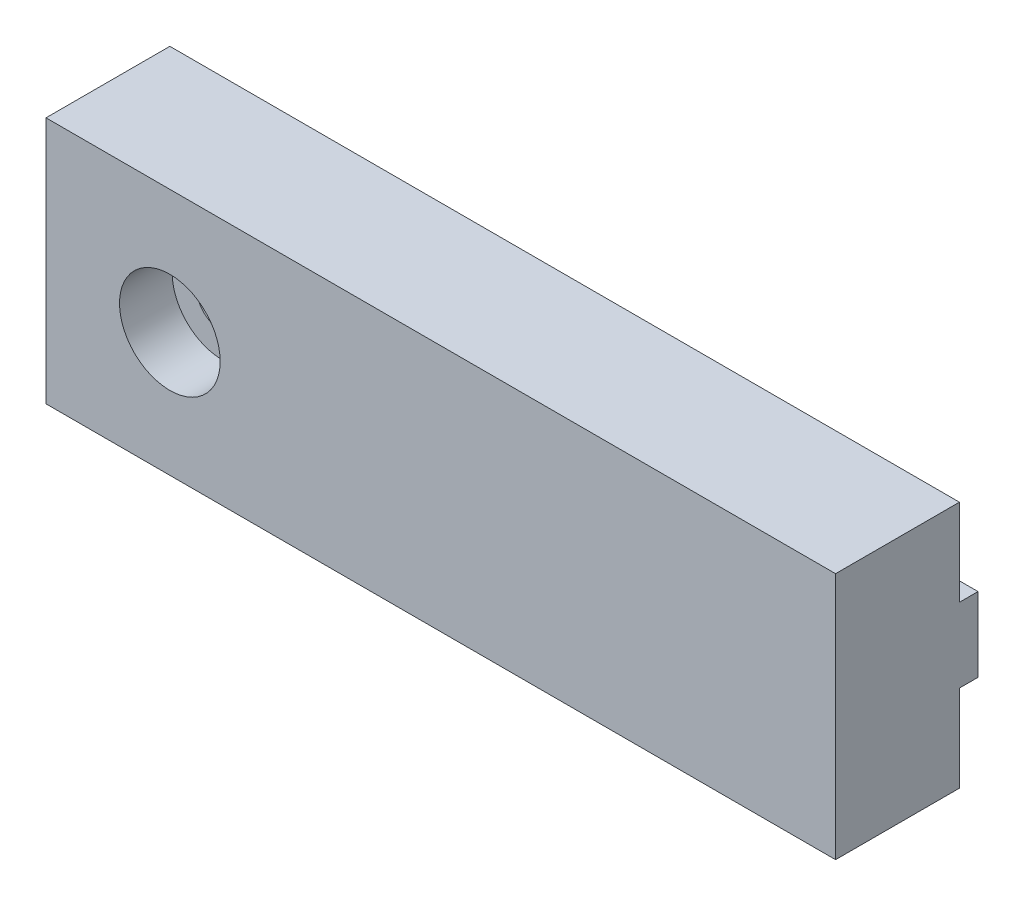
ISO-10303-21;
HEADER;
FILE_DESCRIPTION(('STEP AP214'),'2;1');
FILE_NAME('part.step','',(''),(''),'','','');
FILE_SCHEMA(('AUTOMOTIVE_DESIGN { 1 0 10303 214 1 1 1 1 }'));
ENDSEC;
DATA;
#1=APPLICATION_CONTEXT('core data for automotive mechanical design processes');
#2=APPLICATION_PROTOCOL_DEFINITION('international standard','automotive_design',2000,#1);
#3=PRODUCT_CONTEXT('',#1,'mechanical');
#4=PRODUCT('Part','Part','',(#3));
#5=PRODUCT_RELATED_PRODUCT_CATEGORY('part','',(#4));
#6=PRODUCT_DEFINITION_FORMATION('','',#4);
#7=PRODUCT_DEFINITION_CONTEXT('part definition',#1,'design');
#8=PRODUCT_DEFINITION('design','',#6,#7);
#9=PRODUCT_DEFINITION_SHAPE('','',#8);
#10=(LENGTH_UNIT() NAMED_UNIT(*) SI_UNIT(.MILLI.,.METRE.));
#11=(NAMED_UNIT(*) PLANE_ANGLE_UNIT() SI_UNIT($,.RADIAN.));
#12=(NAMED_UNIT(*) SI_UNIT($,.STERADIAN.) SOLID_ANGLE_UNIT());
#13=UNCERTAINTY_MEASURE_WITH_UNIT(LENGTH_MEASURE(1.E-05),#10,'distance_accuracy_value','');
#14=(GEOMETRIC_REPRESENTATION_CONTEXT(3) GLOBAL_UNCERTAINTY_ASSIGNED_CONTEXT((#13)) GLOBAL_UNIT_ASSIGNED_CONTEXT((#10,
#11,#12)) REPRESENTATION_CONTEXT('',''));
#15=CARTESIAN_POINT('',(0.,0.,0.));
#16=DIRECTION('',(0.,0.,1.));
#17=DIRECTION('',(1.,0.,0.));
#18=AXIS2_PLACEMENT_3D('',#15,#16,#17);
#19=CARTESIAN_POINT('',(0.,0.,0.));
#20=DIRECTION('',(0.,0.,-1.));
#21=DIRECTION('',(-1.,0.,0.));
#22=AXIS2_PLACEMENT_3D('',#19,#20,#21);
#23=PLANE('',#22);
#24=DIRECTION('',(1.,0.,0.));
#25=VECTOR('',#24,1.);
#26=CARTESIAN_POINT('',(25.5,2.4,0.));
#27=LINE('',#26,#25);
#28=CARTESIAN_POINT('',(-25.5,2.4,0.));
#29=VERTEX_POINT('',#28);
#30=CARTESIAN_POINT('',(25.5,2.4,0.));
#31=VERTEX_POINT('',#30);
#32=EDGE_CURVE('E50',#29,#31,#27,.T.);
#33=ORIENTED_EDGE('',*,*,#32,.F.);
#34=DIRECTION('',(0.,-1.,0.));
#35=VECTOR('',#34,1.);
#36=CARTESIAN_POINT('',(-25.5,-8.,0.));
#37=LINE('',#36,#35);
#38=CARTESIAN_POINT('',(-25.5,8.,0.));
#39=VERTEX_POINT('',#38);
#40=EDGE_CURVE('E144',#39,#29,#37,.T.);
#41=ORIENTED_EDGE('',*,*,#40,.F.);
#42=DIRECTION('',(-1.,0.,0.));
#43=VECTOR('',#42,1.);
#44=CARTESIAN_POINT('',(-25.5,8.,0.));
#45=LINE('',#44,#43);
#46=CARTESIAN_POINT('',(25.5,8.,0.));
#47=VERTEX_POINT('',#46);
#48=EDGE_CURVE('E141',#47,#39,#45,.T.);
#49=ORIENTED_EDGE('',*,*,#48,.F.);
#50=DIRECTION('',(0.,1.,0.));
#51=VECTOR('',#50,1.);
#52=CARTESIAN_POINT('',(25.5,-8.,0.));
#53=LINE('',#52,#51);
#54=EDGE_CURVE('E55',#31,#47,#53,.T.);
#55=ORIENTED_EDGE('',*,*,#54,.F.);
#56=EDGE_LOOP('',(#33,#41,#49,#55));
#57=FACE_BOUND('',#56,.T.);
#58=ADVANCED_FACE('F35',(#57),#23,.T.);
#59=CARTESIAN_POINT('',(25.5,-8.,8.));
#60=DIRECTION('',(-1.,0.,0.));
#61=DIRECTION('',(0.,0.,1.));
#62=AXIS2_PLACEMENT_3D('',#59,#60,#61);
#63=PLANE('',#62);
#64=CARTESIAN_POINT('',(25.5,-8.,0.));
#65=VERTEX_POINT('',#64);
#66=CARTESIAN_POINT('',(25.5,-2.4,0.));
#67=VERTEX_POINT('',#66);
#68=EDGE_CURVE('E123',#65,#67,#53,.T.);
#69=ORIENTED_EDGE('',*,*,#68,.T.);
#70=DIRECTION('',(0.,0.,1.));
#71=VECTOR('',#70,1.);
#72=CARTESIAN_POINT('',(25.5,-2.4,-1.2));
#73=LINE('',#72,#71);
#74=CARTESIAN_POINT('',(25.5,-2.4,-1.2));
#75=VERTEX_POINT('',#74);
#76=EDGE_CURVE('E104',#75,#67,#73,.T.);
#77=ORIENTED_EDGE('',*,*,#76,.F.);
#78=DIRECTION('',(0.,-1.,0.));
#79=VECTOR('',#78,1.);
#80=CARTESIAN_POINT('',(25.5,2.4,-1.2));
#81=LINE('',#80,#79);
#82=CARTESIAN_POINT('',(25.5,2.4,-1.2));
#83=VERTEX_POINT('',#82);
#84=EDGE_CURVE('E110',#83,#75,#81,.T.);
#85=ORIENTED_EDGE('',*,*,#84,.F.);
#86=DIRECTION('',(0.,0.,1.));
#87=VECTOR('',#86,1.);
#88=CARTESIAN_POINT('',(25.5,2.4,-1.2));
#89=LINE('',#88,#87);
#90=EDGE_CURVE('E162',#83,#31,#89,.T.);
#91=ORIENTED_EDGE('',*,*,#90,.T.);
#92=ORIENTED_EDGE('',*,*,#54,.T.);
#93=DIRECTION('',(0.,0.,-1.));
#94=VECTOR('',#93,1.);
#95=CARTESIAN_POINT('',(25.5,8.,8.));
#96=LINE('',#95,#94);
#97=CARTESIAN_POINT('',(25.5,8.,8.));
#98=VERTEX_POINT('',#97);
#99=EDGE_CURVE('E11',#98,#47,#96,.T.);
#100=ORIENTED_EDGE('',*,*,#99,.F.);
#101=DIRECTION('',(0.,1.,0.));
#102=VECTOR('',#101,1.);
#103=CARTESIAN_POINT('',(25.5,-8.,8.));
#104=LINE('',#103,#102);
#105=CARTESIAN_POINT('',(25.5,-8.,8.));
#106=VERTEX_POINT('',#105);
#107=EDGE_CURVE('E130',#106,#98,#104,.T.);
#108=ORIENTED_EDGE('',*,*,#107,.F.);
#109=DIRECTION('',(0.,0.,-1.));
#110=VECTOR('',#109,1.);
#111=CARTESIAN_POINT('',(25.5,-8.,8.));
#112=LINE('',#111,#110);
#113=EDGE_CURVE('E139',#106,#65,#112,.T.);
#114=ORIENTED_EDGE('',*,*,#113,.T.);
#115=EDGE_LOOP('',(#69,#77,#85,#91,#92,#100,#108,#114));
#116=FACE_BOUND('',#115,.T.);
#117=ADVANCED_FACE('F37',(#116),#63,.F.);
#118=CARTESIAN_POINT('',(-25.5,8.,8.));
#119=DIRECTION('',(0.,-1.,0.));
#120=DIRECTION('',(0.,0.,-1.));
#121=AXIS2_PLACEMENT_3D('',#118,#119,#120);
#122=PLANE('',#121);
#123=ORIENTED_EDGE('',*,*,#48,.T.);
#124=DIRECTION('',(0.,0.,-1.));
#125=VECTOR('',#124,1.);
#126=CARTESIAN_POINT('',(-25.5,8.,8.));
#127=LINE('',#126,#125);
#128=CARTESIAN_POINT('',(-25.5,8.,8.));
#129=VERTEX_POINT('',#128);
#130=EDGE_CURVE('E43',#129,#39,#127,.T.);
#131=ORIENTED_EDGE('',*,*,#130,.F.);
#132=DIRECTION('',(-1.,0.,0.));
#133=VECTOR('',#132,1.);
#134=CARTESIAN_POINT('',(-25.5,8.,8.));
#135=LINE('',#134,#133);
#136=EDGE_CURVE('E133',#98,#129,#135,.T.);
#137=ORIENTED_EDGE('',*,*,#136,.F.);
#138=ORIENTED_EDGE('',*,*,#99,.T.);
#139=EDGE_LOOP('',(#123,#131,#137,#138));
#140=FACE_BOUND('',#139,.T.);
#141=ADVANCED_FACE('F160',(#140),#122,.F.);
#142=CARTESIAN_POINT('',(-25.5,-8.,8.));
#143=DIRECTION('',(1.,0.,0.));
#144=DIRECTION('',(0.,0.,-1.));
#145=AXIS2_PLACEMENT_3D('',#142,#143,#144);
#146=PLANE('',#145);
#147=ORIENTED_EDGE('',*,*,#40,.T.);
#148=DIRECTION('',(0.,0.,1.));
#149=VECTOR('',#148,1.);
#150=CARTESIAN_POINT('',(-25.5,2.4,-1.2));
#151=LINE('',#150,#149);
#152=CARTESIAN_POINT('',(-25.5,2.4,-1.2));
#153=VERTEX_POINT('',#152);
#154=EDGE_CURVE('E126',#153,#29,#151,.T.);
#155=ORIENTED_EDGE('',*,*,#154,.F.);
#156=DIRECTION('',(0.,1.,0.));
#157=VECTOR('',#156,1.);
#158=CARTESIAN_POINT('',(-25.5,2.4,-1.2));
#159=LINE('',#158,#157);
#160=CARTESIAN_POINT('',(-25.5,-2.4,-1.2));
#161=VERTEX_POINT('',#160);
#162=EDGE_CURVE('E109',#161,#153,#159,.T.);
#163=ORIENTED_EDGE('',*,*,#162,.F.);
#164=DIRECTION('',(0.,0.,1.));
#165=VECTOR('',#164,1.);
#166=CARTESIAN_POINT('',(-25.5,-2.4,-1.2));
#167=LINE('',#166,#165);
#168=CARTESIAN_POINT('',(-25.5,-2.4,0.));
#169=VERTEX_POINT('',#168);
#170=EDGE_CURVE('E106',#161,#169,#167,.T.);
#171=ORIENTED_EDGE('',*,*,#170,.T.);
#172=CARTESIAN_POINT('',(-25.5,-8.,0.));
#173=VERTEX_POINT('',#172);
#174=EDGE_CURVE('E143',#169,#173,#37,.T.);
#175=ORIENTED_EDGE('',*,*,#174,.T.);
#176=DIRECTION('',(0.,0.,-1.));
#177=VECTOR('',#176,1.);
#178=CARTESIAN_POINT('',(-25.5,-8.,8.));
#179=LINE('',#178,#177);
#180=CARTESIAN_POINT('',(-25.5,-8.,8.));
#181=VERTEX_POINT('',#180);
#182=EDGE_CURVE('E148',#181,#173,#179,.T.);
#183=ORIENTED_EDGE('',*,*,#182,.F.);
#184=DIRECTION('',(0.,-1.,0.));
#185=VECTOR('',#184,1.);
#186=CARTESIAN_POINT('',(-25.5,-8.,8.));
#187=LINE('',#186,#185);
#188=EDGE_CURVE('E136',#129,#181,#187,.T.);
#189=ORIENTED_EDGE('',*,*,#188,.F.);
#190=ORIENTED_EDGE('',*,*,#130,.T.);
#191=EDGE_LOOP('',(#147,#155,#163,#171,#175,#183,#189,#190));
#192=FACE_BOUND('',#191,.T.);
#193=ADVANCED_FACE('F154',(#192),#146,.F.);
#194=CARTESIAN_POINT('',(-25.5,-8.,8.));
#195=DIRECTION('',(0.,1.,0.));
#196=DIRECTION('',(0.,0.,1.));
#197=AXIS2_PLACEMENT_3D('',#194,#195,#196);
#198=PLANE('',#197);
#199=DIRECTION('',(1.,0.,0.));
#200=VECTOR('',#199,1.);
#201=CARTESIAN_POINT('',(-25.5,-8.,0.));
#202=LINE('',#201,#200);
#203=EDGE_CURVE('E134',#173,#65,#202,.T.);
#204=ORIENTED_EDGE('',*,*,#203,.T.);
#205=ORIENTED_EDGE('',*,*,#113,.F.);
#206=DIRECTION('',(1.,0.,0.));
#207=VECTOR('',#206,1.);
#208=CARTESIAN_POINT('',(-25.5,-8.,8.));
#209=LINE('',#208,#207);
#210=EDGE_CURVE('E138',#181,#106,#209,.T.);
#211=ORIENTED_EDGE('',*,*,#210,.F.);
#212=ORIENTED_EDGE('',*,*,#182,.T.);
#213=EDGE_LOOP('',(#204,#205,#211,#212));
#214=FACE_BOUND('',#213,.T.);
#215=ADVANCED_FACE('F190',(#214),#198,.F.);
#216=CARTESIAN_POINT('',(0.,0.,8.));
#217=DIRECTION('',(0.,0.,-1.));
#218=DIRECTION('',(-1.,0.,0.));
#219=AXIS2_PLACEMENT_3D('',#216,#217,#218);
#220=PLANE('',#219);
#221=CARTESIAN_POINT('',(-17.5,0.,8.));
#222=DIRECTION('',(0.,0.,1.));
#223=DIRECTION('',(1.,0.,0.));
#224=AXIS2_PLACEMENT_3D('',#221,#222,#223);
#225=CIRCLE('',#224,3.25);
#226=CARTESIAN_POINT('',(-14.25,0.,8.));
#227=VERTEX_POINT('',#226);
#228=EDGE_CURVE('E180',#227,#227,#225,.T.);
#229=ORIENTED_EDGE('',*,*,#228,.F.);
#230=EDGE_LOOP('',(#229));
#231=FACE_BOUND('',#230,.T.);
#232=ORIENTED_EDGE('',*,*,#107,.T.);
#233=ORIENTED_EDGE('',*,*,#136,.T.);
#234=ORIENTED_EDGE('',*,*,#188,.T.);
#235=ORIENTED_EDGE('',*,*,#210,.T.);
#236=EDGE_LOOP('',(#232,#233,#234,#235));
#237=FACE_BOUND('',#236,.T.);
#238=ADVANCED_FACE('F186',(#231,#237),#220,.F.);
#239=DIRECTION('',(-1.,0.,0.));
#240=VECTOR('',#239,1.);
#241=CARTESIAN_POINT('',(25.5,-2.4,0.));
#242=LINE('',#241,#240);
#243=EDGE_CURVE('E168',#67,#169,#242,.T.);
#244=ORIENTED_EDGE('',*,*,#243,.F.);
#245=ORIENTED_EDGE('',*,*,#68,.F.);
#246=ORIENTED_EDGE('',*,*,#203,.F.);
#247=ORIENTED_EDGE('',*,*,#174,.F.);
#248=EDGE_LOOP('',(#244,#245,#246,#247));
#249=FACE_BOUND('',#248,.T.);
#250=ADVANCED_FACE('F189',(#249),#23,.T.);
#251=CARTESIAN_POINT('',(25.5,-2.4,-1.2));
#252=DIRECTION('',(0.,1.,0.));
#253=DIRECTION('',(-1.,0.,0.));
#254=AXIS2_PLACEMENT_3D('',#251,#252,#253);
#255=PLANE('',#254);
#256=ORIENTED_EDGE('',*,*,#243,.T.);
#257=ORIENTED_EDGE('',*,*,#170,.F.);
#258=DIRECTION('',(-1.,0.,0.));
#259=VECTOR('',#258,1.);
#260=CARTESIAN_POINT('',(25.5,-2.4,-1.2));
#261=LINE('',#260,#259);
#262=EDGE_CURVE('E99',#75,#161,#261,.T.);
#263=ORIENTED_EDGE('',*,*,#262,.F.);
#264=ORIENTED_EDGE('',*,*,#76,.T.);
#265=EDGE_LOOP('',(#256,#257,#263,#264));
#266=FACE_BOUND('',#265,.T.);
#267=ADVANCED_FACE('F102',(#266),#255,.F.);
#268=CARTESIAN_POINT('',(25.5,2.4,-1.2));
#269=DIRECTION('',(0.,-1.,0.));
#270=DIRECTION('',(1.,0.,0.));
#271=AXIS2_PLACEMENT_3D('',#268,#269,#270);
#272=PLANE('',#271);
#273=ORIENTED_EDGE('',*,*,#32,.T.);
#274=ORIENTED_EDGE('',*,*,#90,.F.);
#275=DIRECTION('',(1.,0.,0.));
#276=VECTOR('',#275,1.);
#277=CARTESIAN_POINT('',(25.5,2.4,-1.2));
#278=LINE('',#277,#276);
#279=EDGE_CURVE('E115',#153,#83,#278,.T.);
#280=ORIENTED_EDGE('',*,*,#279,.F.);
#281=ORIENTED_EDGE('',*,*,#154,.T.);
#282=EDGE_LOOP('',(#273,#274,#280,#281));
#283=FACE_BOUND('',#282,.T.);
#284=ADVANCED_FACE('F197',(#283),#272,.F.);
#285=CARTESIAN_POINT('',(0.,0.,-1.2));
#286=DIRECTION('',(0.,0.,-1.));
#287=DIRECTION('',(-1.,0.,0.));
#288=AXIS2_PLACEMENT_3D('',#285,#286,#287);
#289=PLANE('',#288);
#290=CARTESIAN_POINT('',(-17.5,0.,-1.2));
#291=DIRECTION('',(0.,0.,1.));
#292=DIRECTION('',(1.,0.,0.));
#293=AXIS2_PLACEMENT_3D('',#290,#291,#292);
#294=CIRCLE('',#293,1.7);
#295=CARTESIAN_POINT('',(-15.8,0.,-1.2));
#296=VERTEX_POINT('',#295);
#297=EDGE_CURVE('E169',#296,#296,#294,.T.);
#298=ORIENTED_EDGE('',*,*,#297,.T.);
#299=EDGE_LOOP('',(#298));
#300=FACE_BOUND('',#299,.T.);
#301=ORIENTED_EDGE('',*,*,#84,.T.);
#302=ORIENTED_EDGE('',*,*,#262,.T.);
#303=ORIENTED_EDGE('',*,*,#162,.T.);
#304=ORIENTED_EDGE('',*,*,#279,.T.);
#305=EDGE_LOOP('',(#301,#302,#303,#304));
#306=FACE_BOUND('',#305,.T.);
#307=ADVANCED_FACE('F113',(#300,#306),#289,.T.);
#308=CARTESIAN_POINT('',(-17.5,0.,8.));
#309=DIRECTION('',(0.,0.,1.));
#310=DIRECTION('',(1.,0.,0.));
#311=AXIS2_PLACEMENT_3D('',#308,#309,#310);
#312=CYLINDRICAL_SURFACE('',#311,1.7);
#313=ORIENTED_EDGE('',*,*,#297,.F.);
#314=EDGE_LOOP('',(#313));
#315=FACE_BOUND('',#314,.T.);
#316=CARTESIAN_POINT('',(-17.5,0.,4.6));
#317=DIRECTION('',(0.,0.,1.));
#318=DIRECTION('',(1.,0.,0.));
#319=AXIS2_PLACEMENT_3D('',#316,#317,#318);
#320=CIRCLE('',#319,1.7);
#321=CARTESIAN_POINT('',(-15.8,0.,4.6));
#322=VERTEX_POINT('',#321);
#323=EDGE_CURVE('E174',#322,#322,#320,.T.);
#324=ORIENTED_EDGE('',*,*,#323,.T.);
#325=EDGE_LOOP('',(#324));
#326=FACE_BOUND('',#325,.T.);
#327=ADVANCED_FACE('F204',(#315,#326),#312,.F.);
#328=CARTESIAN_POINT('',(-15.8,0.,4.6));
#329=DIRECTION('',(0.,0.,-1.));
#330=DIRECTION('',(-1.,0.,0.));
#331=AXIS2_PLACEMENT_3D('',#328,#329,#330);
#332=PLANE('',#331);
#333=ORIENTED_EDGE('',*,*,#323,.F.);
#334=EDGE_LOOP('',(#333));
#335=FACE_BOUND('',#334,.T.);
#336=CARTESIAN_POINT('',(-17.5,0.,4.6));
#337=DIRECTION('',(0.,0.,1.));
#338=DIRECTION('',(1.,0.,0.));
#339=AXIS2_PLACEMENT_3D('',#336,#337,#338);
#340=CIRCLE('',#339,3.25);
#341=CARTESIAN_POINT('',(-14.25,0.,4.6));
#342=VERTEX_POINT('',#341);
#343=EDGE_CURVE('E177',#342,#342,#340,.T.);
#344=ORIENTED_EDGE('',*,*,#343,.T.);
#345=EDGE_LOOP('',(#344));
#346=FACE_BOUND('',#345,.T.);
#347=ADVANCED_FACE('F250',(#335,#346),#332,.F.);
#348=CARTESIAN_POINT('',(-17.5,0.,8.));
#349=DIRECTION('',(0.,0.,1.));
#350=DIRECTION('',(1.,0.,0.));
#351=AXIS2_PLACEMENT_3D('',#348,#349,#350);
#352=CYLINDRICAL_SURFACE('',#351,3.25);
#353=ORIENTED_EDGE('',*,*,#343,.F.);
#354=EDGE_LOOP('',(#353));
#355=FACE_BOUND('',#354,.T.);
#356=ORIENTED_EDGE('',*,*,#228,.T.);
#357=EDGE_LOOP('',(#356));
#358=FACE_BOUND('',#357,.T.);
#359=ADVANCED_FACE('F184',(#355,#358),#352,.F.);
#360=CLOSED_SHELL('',(#58,#117,#141,#193,#215,#238,#250,#267,#284,#307,#327,#347,#359));
#361=MANIFOLD_SOLID_BREP('B2',#360);
#362=ADVANCED_BREP_SHAPE_REPRESENTATION('',(#18,#361),#14);
#363=SHAPE_DEFINITION_REPRESENTATION(#9,#362);
ENDSEC;
END-ISO-10303-21;
